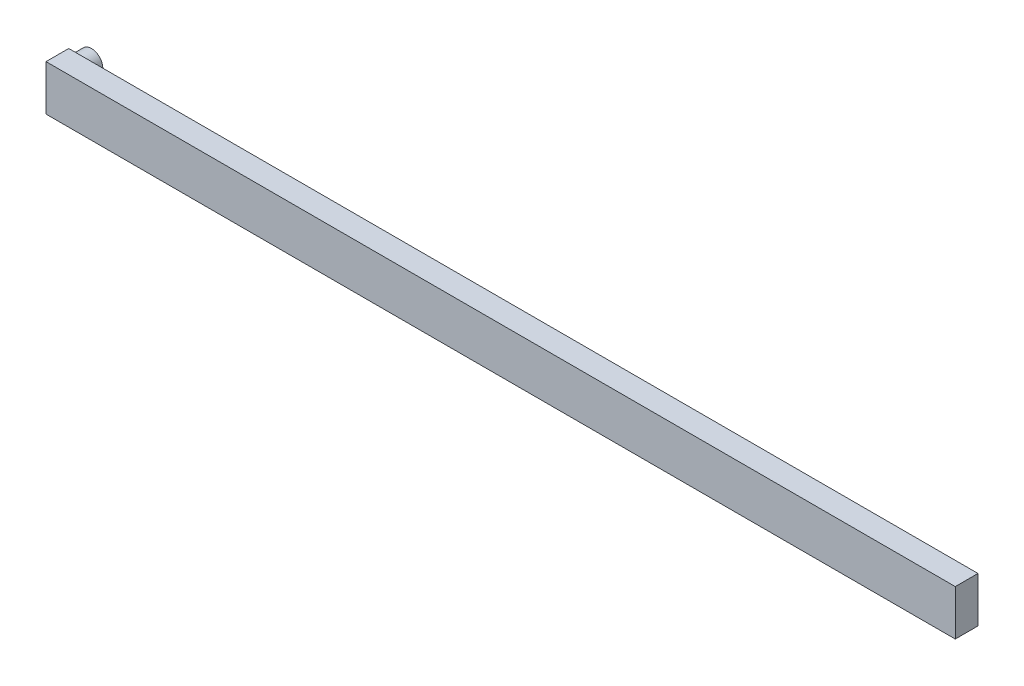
from build123d import *

# Parameters (mm, degrees)
BOSS_EXTRUDE1_DEPTH      = 10
BOSS_EXTRUDE1_DEPTH_BACK = 10
SKETCH1_W                = 800
SKETCH1_H                = 40
SKETCH2_R                = 10
BOSS_EXTRUDE2_DEPTH      = 20


with BuildPart() as part:
    # Sketch1 → Boss-Extrude1 (new, two sides: drawn at the far end of the back side and taken through both)
    with BuildSketch(Plane.XY.offset(-BOSS_EXTRUDE1_DEPTH_BACK)):
        Rectangle(SKETCH1_W, SKETCH1_H)
    extrude(amount=BOSS_EXTRUDE1_DEPTH + BOSS_EXTRUDE1_DEPTH_BACK)

    # Sketch2 → Boss-Extrude2 (add)
    with BuildSketch(Plane(origin=(0, 0, -10), x_dir=(-1, 0, 0), z_dir=(0, 0, -1))):
        with Locations(Location((400, 0, 0), (0, 0, 270))):
            Circle(SKETCH2_R)
    extrude(amount=BOSS_EXTRUDE2_DEPTH)


solid = part.part
